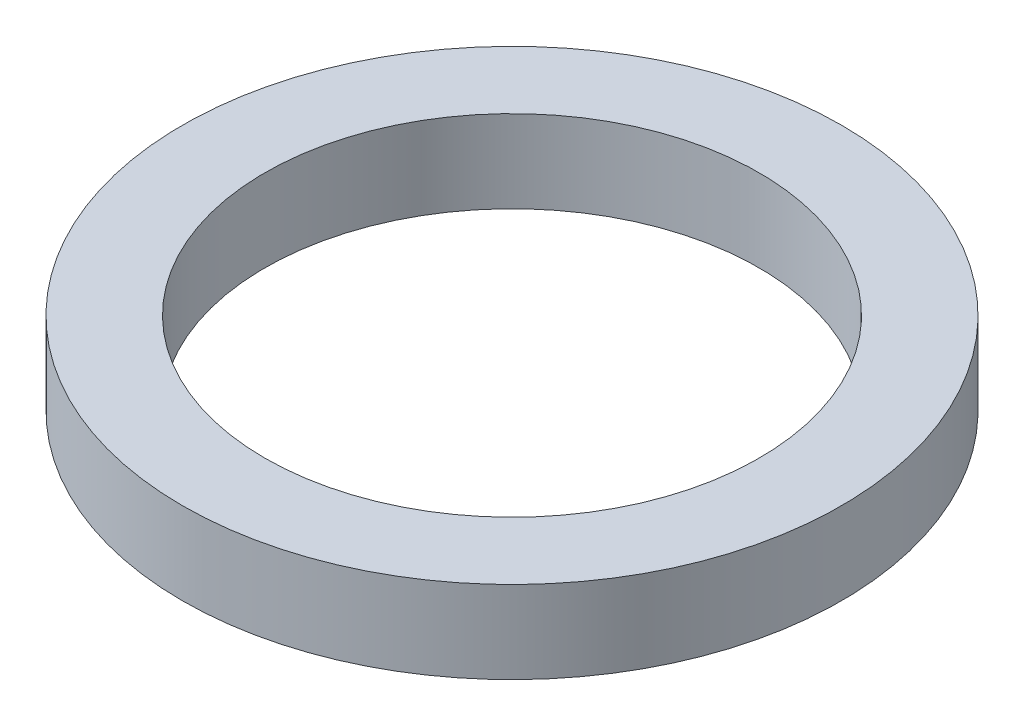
ISO-10303-21;
HEADER;
FILE_DESCRIPTION(('STEP AP214'),'2;1');
FILE_NAME('part.step','',(''),(''),'','','');
FILE_SCHEMA(('AUTOMOTIVE_DESIGN { 1 0 10303 214 1 1 1 1 }'));
ENDSEC;
DATA;
#1=APPLICATION_CONTEXT('core data for automotive mechanical design processes');
#2=APPLICATION_PROTOCOL_DEFINITION('international standard','automotive_design',2000,#1);
#3=PRODUCT_CONTEXT('',#1,'mechanical');
#4=PRODUCT('Part','Part','',(#3));
#5=PRODUCT_RELATED_PRODUCT_CATEGORY('part','',(#4));
#6=PRODUCT_DEFINITION_FORMATION('','',#4);
#7=PRODUCT_DEFINITION_CONTEXT('part definition',#1,'design');
#8=PRODUCT_DEFINITION('design','',#6,#7);
#9=PRODUCT_DEFINITION_SHAPE('','',#8);
#10=(LENGTH_UNIT() NAMED_UNIT(*) SI_UNIT(.MILLI.,.METRE.));
#11=(NAMED_UNIT(*) PLANE_ANGLE_UNIT() SI_UNIT($,.RADIAN.));
#12=(NAMED_UNIT(*) SI_UNIT($,.STERADIAN.) SOLID_ANGLE_UNIT());
#13=UNCERTAINTY_MEASURE_WITH_UNIT(LENGTH_MEASURE(1.E-05),#10,'distance_accuracy_value','');
#14=(GEOMETRIC_REPRESENTATION_CONTEXT(3) GLOBAL_UNCERTAINTY_ASSIGNED_CONTEXT((#13)) GLOBAL_UNIT_ASSIGNED_CONTEXT((#10,
#11,#12)) REPRESENTATION_CONTEXT('',''));
#15=CARTESIAN_POINT('',(0.,0.,0.));
#16=DIRECTION('',(0.,0.,1.));
#17=DIRECTION('',(1.,0.,0.));
#18=AXIS2_PLACEMENT_3D('',#15,#16,#17);
#19=CARTESIAN_POINT('',(0.,2.,0.));
#20=DIRECTION('',(0.,1.,0.));
#21=DIRECTION('',(0.,0.,1.));
#22=AXIS2_PLACEMENT_3D('',#19,#20,#21);
#23=PLANE('',#22);
#24=CARTESIAN_POINT('',(0.,2.,0.));
#25=DIRECTION('',(0.,1.,0.));
#26=DIRECTION('',(0.,0.,1.));
#27=AXIS2_PLACEMENT_3D('',#24,#25,#26);
#28=CIRCLE('',#27,8.);
#29=CARTESIAN_POINT('',(0.,2.,8.));
#30=VERTEX_POINT('',#29);
#31=EDGE_CURVE('E10',#30,#30,#28,.T.);
#32=ORIENTED_EDGE('',*,*,#31,.T.);
#33=EDGE_LOOP('',(#32));
#34=FACE_BOUND('',#33,.T.);
#35=CARTESIAN_POINT('',(0.,2.,0.));
#36=DIRECTION('',(0.,1.,0.));
#37=DIRECTION('',(0.,0.,1.));
#38=AXIS2_PLACEMENT_3D('',#35,#36,#37);
#39=CIRCLE('',#38,6.);
#40=CARTESIAN_POINT('',(0.,2.,6.));
#41=VERTEX_POINT('',#40);
#42=EDGE_CURVE('E45',#41,#41,#39,.T.);
#43=ORIENTED_EDGE('',*,*,#42,.F.);
#44=EDGE_LOOP('',(#43));
#45=FACE_BOUND('',#44,.T.);
#46=ADVANCED_FACE('F34',(#34,#45),#23,.T.);
#47=CARTESIAN_POINT('',(0.,0.,0.));
#48=DIRECTION('',(0.,1.,0.));
#49=DIRECTION('',(0.,0.,1.));
#50=AXIS2_PLACEMENT_3D('',#47,#48,#49);
#51=PLANE('',#50);
#52=CARTESIAN_POINT('',(0.,0.,0.));
#53=DIRECTION('',(0.,1.,0.));
#54=DIRECTION('',(0.,0.,1.));
#55=AXIS2_PLACEMENT_3D('',#52,#53,#54);
#56=CIRCLE('',#55,8.);
#57=CARTESIAN_POINT('',(0.,0.,8.));
#58=VERTEX_POINT('',#57);
#59=EDGE_CURVE('E38',#58,#58,#56,.T.);
#60=ORIENTED_EDGE('',*,*,#59,.F.);
#61=EDGE_LOOP('',(#60));
#62=FACE_BOUND('',#61,.T.);
#63=CARTESIAN_POINT('',(0.,0.,0.));
#64=DIRECTION('',(0.,1.,0.));
#65=DIRECTION('',(0.,0.,1.));
#66=AXIS2_PLACEMENT_3D('',#63,#64,#65);
#67=CIRCLE('',#66,6.);
#68=CARTESIAN_POINT('',(0.,0.,6.));
#69=VERTEX_POINT('',#68);
#70=EDGE_CURVE('E47',#69,#69,#67,.T.);
#71=ORIENTED_EDGE('',*,*,#70,.T.);
#72=EDGE_LOOP('',(#71));
#73=FACE_BOUND('',#72,.T.);
#74=ADVANCED_FACE('F57',(#62,#73),#51,.F.);
#75=CARTESIAN_POINT('',(0.,2.,0.));
#76=DIRECTION('',(0.,-1.,0.));
#77=DIRECTION('',(0.,0.,-1.));
#78=AXIS2_PLACEMENT_3D('',#75,#76,#77);
#79=CYLINDRICAL_SURFACE('',#78,8.);
#80=ORIENTED_EDGE('',*,*,#31,.F.);
#81=EDGE_LOOP('',(#80));
#82=FACE_BOUND('',#81,.T.);
#83=ORIENTED_EDGE('',*,*,#59,.T.);
#84=EDGE_LOOP('',(#83));
#85=FACE_BOUND('',#84,.T.);
#86=ADVANCED_FACE('F36',(#82,#85),#79,.T.);
#87=CARTESIAN_POINT('',(0.,2.,0.));
#88=DIRECTION('',(0.,-1.,0.));
#89=DIRECTION('',(0.,0.,-1.));
#90=AXIS2_PLACEMENT_3D('',#87,#88,#89);
#91=CYLINDRICAL_SURFACE('',#90,6.);
#92=ORIENTED_EDGE('',*,*,#42,.T.);
#93=EDGE_LOOP('',(#92));
#94=FACE_BOUND('',#93,.T.);
#95=ORIENTED_EDGE('',*,*,#70,.F.);
#96=EDGE_LOOP('',(#95));
#97=FACE_BOUND('',#96,.T.);
#98=ADVANCED_FACE('F53',(#94,#97),#91,.F.);
#99=CLOSED_SHELL('',(#46,#74,#86,#98));
#100=MANIFOLD_SOLID_BREP('B2',#99);
#101=ADVANCED_BREP_SHAPE_REPRESENTATION('',(#18,#100),#14);
#102=SHAPE_DEFINITION_REPRESENTATION(#9,#101);
ENDSEC;
END-ISO-10303-21;
